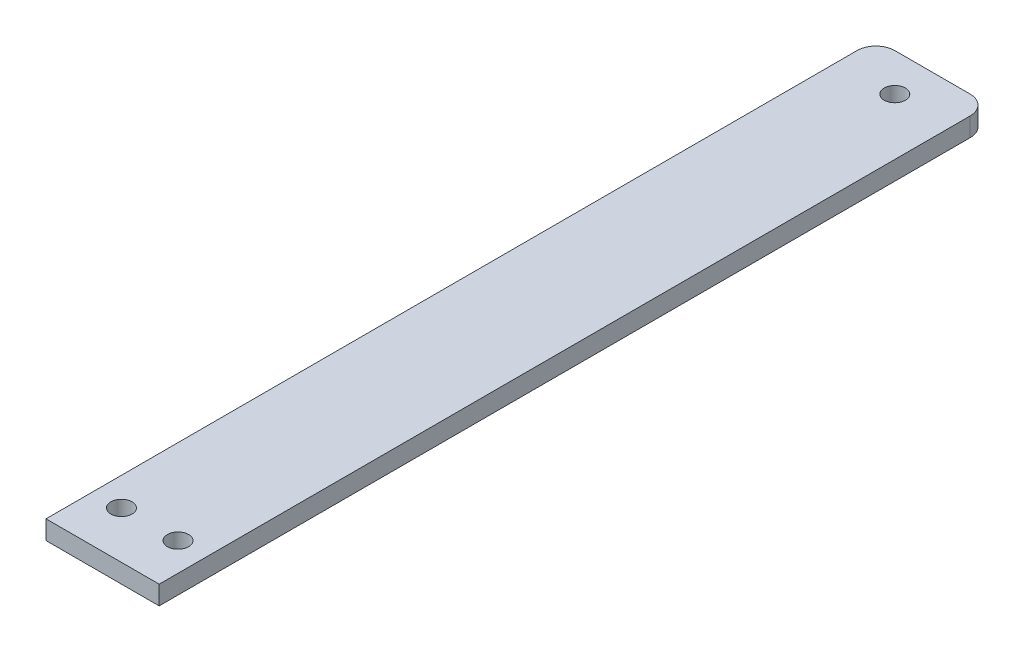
ISO-10303-21;
HEADER;
FILE_DESCRIPTION(('STEP AP214'),'2;1');
FILE_NAME('part.step','',(''),(''),'','','');
FILE_SCHEMA(('AUTOMOTIVE_DESIGN { 1 0 10303 214 1 1 1 1 }'));
ENDSEC;
DATA;
#1=APPLICATION_CONTEXT('core data for automotive mechanical design processes');
#2=APPLICATION_PROTOCOL_DEFINITION('international standard','automotive_design',2000,#1);
#3=PRODUCT_CONTEXT('',#1,'mechanical');
#4=PRODUCT('Part','Part','',(#3));
#5=PRODUCT_RELATED_PRODUCT_CATEGORY('part','',(#4));
#6=PRODUCT_DEFINITION_FORMATION('','',#4);
#7=PRODUCT_DEFINITION_CONTEXT('part definition',#1,'design');
#8=PRODUCT_DEFINITION('design','',#6,#7);
#9=PRODUCT_DEFINITION_SHAPE('','',#8);
#10=(LENGTH_UNIT() NAMED_UNIT(*) SI_UNIT(.MILLI.,.METRE.));
#11=(NAMED_UNIT(*) PLANE_ANGLE_UNIT() SI_UNIT($,.RADIAN.));
#12=(NAMED_UNIT(*) SI_UNIT($,.STERADIAN.) SOLID_ANGLE_UNIT());
#13=UNCERTAINTY_MEASURE_WITH_UNIT(LENGTH_MEASURE(1.E-05),#10,'distance_accuracy_value','');
#14=(GEOMETRIC_REPRESENTATION_CONTEXT(3) GLOBAL_UNCERTAINTY_ASSIGNED_CONTEXT((#13)) GLOBAL_UNIT_ASSIGNED_CONTEXT((#10,
#11,#12)) REPRESENTATION_CONTEXT('',''));
#15=CARTESIAN_POINT('',(0.,0.,0.));
#16=DIRECTION('',(0.,0.,1.));
#17=DIRECTION('',(1.,0.,0.));
#18=AXIS2_PLACEMENT_3D('',#15,#16,#17);
#19=CARTESIAN_POINT('',(0.,6.35,0.));
#20=DIRECTION('',(0.,-1.,0.));
#21=DIRECTION('',(0.,0.,-1.));
#22=AXIS2_PLACEMENT_3D('',#19,#20,#21);
#23=PLANE('',#22);
#24=DIRECTION('',(-1.,0.,0.));
#25=VECTOR('',#24,1.);
#26=CARTESIAN_POINT('',(-19.05,6.35,-139.7));
#27=LINE('',#26,#25);
#28=CARTESIAN_POINT('',(12.7,6.35,-139.7));
#29=VERTEX_POINT('',#28);
#30=CARTESIAN_POINT('',(-12.7,6.35,-139.7));
#31=VERTEX_POINT('',#30);
#32=EDGE_CURVE('E105',#29,#31,#27,.T.);
#33=ORIENTED_EDGE('',*,*,#32,.T.);
#34=CARTESIAN_POINT('',(-12.7,6.35,-133.35));
#35=DIRECTION('',(0.,-1.,0.));
#36=DIRECTION('',(0.,0.,-1.));
#37=AXIS2_PLACEMENT_3D('',#34,#35,#36);
#38=CIRCLE('',#37,6.35);
#39=CARTESIAN_POINT('',(-19.05,6.35,-133.35));
#40=VERTEX_POINT('',#39);
#41=EDGE_CURVE('E48',#31,#40,#38,.F.);
#42=ORIENTED_EDGE('',*,*,#41,.T.);
#43=DIRECTION('',(0.,0.,1.));
#44=VECTOR('',#43,1.);
#45=CARTESIAN_POINT('',(-19.05,6.35,139.7));
#46=LINE('',#45,#44);
#47=CARTESIAN_POINT('',(-19.05,6.35,139.7));
#48=VERTEX_POINT('',#47);
#49=EDGE_CURVE('E94',#40,#48,#46,.T.);
#50=ORIENTED_EDGE('',*,*,#49,.T.);
#51=DIRECTION('',(1.,0.,0.));
#52=VECTOR('',#51,1.);
#53=CARTESIAN_POINT('',(-19.05,6.35,139.7));
#54=LINE('',#53,#52);
#55=CARTESIAN_POINT('',(19.05,6.35,139.7));
#56=VERTEX_POINT('',#55);
#57=EDGE_CURVE('E98',#48,#56,#54,.T.);
#58=ORIENTED_EDGE('',*,*,#57,.T.);
#59=DIRECTION('',(0.,0.,-1.));
#60=VECTOR('',#59,1.);
#61=CARTESIAN_POINT('',(19.05,6.35,139.7));
#62=LINE('',#61,#60);
#63=CARTESIAN_POINT('',(19.05,6.35,-133.35));
#64=VERTEX_POINT('',#63);
#65=EDGE_CURVE('E137',#56,#64,#62,.T.);
#66=ORIENTED_EDGE('',*,*,#65,.T.);
#67=CARTESIAN_POINT('',(12.7,6.35,-133.35));
#68=DIRECTION('',(0.,-1.,0.));
#69=DIRECTION('',(0.,0.,-1.));
#70=AXIS2_PLACEMENT_3D('',#67,#68,#69);
#71=CIRCLE('',#70,6.35);
#72=EDGE_CURVE('E153',#64,#29,#71,.F.);
#73=ORIENTED_EDGE('',*,*,#72,.T.);
#74=EDGE_LOOP('',(#33,#42,#50,#58,#66,#73));
#75=FACE_BOUND('',#74,.T.);
#76=CARTESIAN_POINT('',(0.,6.35,-127.));
#77=DIRECTION('',(0.,1.,0.));
#78=DIRECTION('',(0.,0.,1.));
#79=AXIS2_PLACEMENT_3D('',#76,#77,#78);
#80=CIRCLE('',#79,3.571875);
#81=CARTESIAN_POINT('',(0.,6.35,-123.428125));
#82=VERTEX_POINT('',#81);
#83=EDGE_CURVE('E130',#82,#82,#80,.T.);
#84=ORIENTED_EDGE('',*,*,#83,.F.);
#85=EDGE_LOOP('',(#84));
#86=FACE_BOUND('',#85,.T.);
#87=CARTESIAN_POINT('',(-9.52499999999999,6.35,123.825));
#88=DIRECTION('',(0.,1.,0.));
#89=DIRECTION('',(0.,0.,1.));
#90=AXIS2_PLACEMENT_3D('',#87,#88,#89);
#91=CIRCLE('',#90,3.571875);
#92=CARTESIAN_POINT('',(-9.52499999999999,6.35,127.396875));
#93=VERTEX_POINT('',#92);
#94=EDGE_CURVE('E174',#93,#93,#91,.T.);
#95=ORIENTED_EDGE('',*,*,#94,.F.);
#96=EDGE_LOOP('',(#95));
#97=FACE_BOUND('',#96,.T.);
#98=CARTESIAN_POINT('',(9.52500000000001,6.35,123.825));
#99=DIRECTION('',(0.,1.,0.));
#100=DIRECTION('',(0.,0.,1.));
#101=AXIS2_PLACEMENT_3D('',#98,#99,#100);
#102=CIRCLE('',#101,3.571875);
#103=CARTESIAN_POINT('',(9.52500000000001,6.35,127.396875));
#104=VERTEX_POINT('',#103);
#105=EDGE_CURVE('E182',#104,#104,#102,.T.);
#106=ORIENTED_EDGE('',*,*,#105,.F.);
#107=EDGE_LOOP('',(#106));
#108=FACE_BOUND('',#107,.T.);
#109=ADVANCED_FACE('F39',(#75,#86,#97,#108),#23,.F.);
#110=CARTESIAN_POINT('',(0.,0.,0.));
#111=DIRECTION('',(0.,-1.,0.));
#112=DIRECTION('',(0.,0.,-1.));
#113=AXIS2_PLACEMENT_3D('',#110,#111,#112);
#114=PLANE('',#113);
#115=CARTESIAN_POINT('',(-9.52499999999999,0.,123.825));
#116=DIRECTION('',(0.,1.,0.));
#117=DIRECTION('',(0.,0.,1.));
#118=AXIS2_PLACEMENT_3D('',#115,#116,#117);
#119=CIRCLE('',#118,3.571875);
#120=CARTESIAN_POINT('',(-9.52499999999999,0.,127.396875));
#121=VERTEX_POINT('',#120);
#122=EDGE_CURVE('E178',#121,#121,#119,.T.);
#123=ORIENTED_EDGE('',*,*,#122,.T.);
#124=EDGE_LOOP('',(#123));
#125=FACE_BOUND('',#124,.T.);
#126=DIRECTION('',(0.,0.,1.));
#127=VECTOR('',#126,1.);
#128=CARTESIAN_POINT('',(-19.05,0.,139.7));
#129=LINE('',#128,#127);
#130=CARTESIAN_POINT('',(-19.05,0.,-133.35));
#131=VERTEX_POINT('',#130);
#132=CARTESIAN_POINT('',(-19.05,0.,139.7));
#133=VERTEX_POINT('',#132);
#134=EDGE_CURVE('E111',#131,#133,#129,.T.);
#135=ORIENTED_EDGE('',*,*,#134,.F.);
#136=CARTESIAN_POINT('',(-12.7,0.,-133.35));
#137=DIRECTION('',(0.,-1.,0.));
#138=DIRECTION('',(0.,0.,-1.));
#139=AXIS2_PLACEMENT_3D('',#136,#137,#138);
#140=CIRCLE('',#139,6.35);
#141=CARTESIAN_POINT('',(-12.7,0.,-139.7));
#142=VERTEX_POINT('',#141);
#143=EDGE_CURVE('E144',#131,#142,#140,.T.);
#144=ORIENTED_EDGE('',*,*,#143,.T.);
#145=DIRECTION('',(-1.,0.,0.));
#146=VECTOR('',#145,1.);
#147=CARTESIAN_POINT('',(-19.05,0.,-139.7));
#148=LINE('',#147,#146);
#149=CARTESIAN_POINT('',(12.7,0.,-139.7));
#150=VERTEX_POINT('',#149);
#151=EDGE_CURVE('E129',#150,#142,#148,.T.);
#152=ORIENTED_EDGE('',*,*,#151,.F.);
#153=CARTESIAN_POINT('',(12.7,0.,-133.35));
#154=DIRECTION('',(0.,-1.,0.));
#155=DIRECTION('',(0.,0.,-1.));
#156=AXIS2_PLACEMENT_3D('',#153,#154,#155);
#157=CIRCLE('',#156,6.35);
#158=CARTESIAN_POINT('',(19.05,0.,-133.35));
#159=VERTEX_POINT('',#158);
#160=EDGE_CURVE('E141',#150,#159,#157,.T.);
#161=ORIENTED_EDGE('',*,*,#160,.T.);
#162=DIRECTION('',(0.,0.,-1.));
#163=VECTOR('',#162,1.);
#164=CARTESIAN_POINT('',(19.05,0.,139.7));
#165=LINE('',#164,#163);
#166=CARTESIAN_POINT('',(19.05,0.,139.7));
#167=VERTEX_POINT('',#166);
#168=EDGE_CURVE('E126',#167,#159,#165,.T.);
#169=ORIENTED_EDGE('',*,*,#168,.F.);
#170=DIRECTION('',(1.,0.,0.));
#171=VECTOR('',#170,1.);
#172=CARTESIAN_POINT('',(-19.05,0.,139.7));
#173=LINE('',#172,#171);
#174=EDGE_CURVE('E135',#133,#167,#173,.T.);
#175=ORIENTED_EDGE('',*,*,#174,.F.);
#176=EDGE_LOOP('',(#135,#144,#152,#161,#169,#175));
#177=FACE_BOUND('',#176,.T.);
#178=CARTESIAN_POINT('',(0.,0.,-127.));
#179=DIRECTION('',(0.,1.,0.));
#180=DIRECTION('',(0.,0.,1.));
#181=AXIS2_PLACEMENT_3D('',#178,#179,#180);
#182=CIRCLE('',#181,3.571875);
#183=CARTESIAN_POINT('',(0.,0.,-123.428125));
#184=VERTEX_POINT('',#183);
#185=EDGE_CURVE('E170',#184,#184,#182,.T.);
#186=ORIENTED_EDGE('',*,*,#185,.T.);
#187=EDGE_LOOP('',(#186));
#188=FACE_BOUND('',#187,.T.);
#189=CARTESIAN_POINT('',(9.52500000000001,0.,123.825));
#190=DIRECTION('',(0.,1.,0.));
#191=DIRECTION('',(0.,0.,1.));
#192=AXIS2_PLACEMENT_3D('',#189,#190,#191);
#193=CIRCLE('',#192,3.571875);
#194=CARTESIAN_POINT('',(9.52500000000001,0.,127.396875));
#195=VERTEX_POINT('',#194);
#196=EDGE_CURVE('E186',#195,#195,#193,.T.);
#197=ORIENTED_EDGE('',*,*,#196,.T.);
#198=EDGE_LOOP('',(#197));
#199=FACE_BOUND('',#198,.T.);
#200=ADVANCED_FACE('F164',(#125,#177,#188,#199),#114,.T.);
#201=CARTESIAN_POINT('',(19.05,6.35,139.7));
#202=DIRECTION('',(-1.,0.,0.));
#203=DIRECTION('',(0.,0.,1.));
#204=AXIS2_PLACEMENT_3D('',#201,#202,#203);
#205=PLANE('',#204);
#206=ORIENTED_EDGE('',*,*,#168,.T.);
#207=DIRECTION('',(0.,-1.,0.));
#208=VECTOR('',#207,1.);
#209=CARTESIAN_POINT('',(19.05,6.35,-133.35));
#210=LINE('',#209,#208);
#211=EDGE_CURVE('E11',#159,#64,#210,.F.);
#212=ORIENTED_EDGE('',*,*,#211,.T.);
#213=ORIENTED_EDGE('',*,*,#65,.F.);
#214=DIRECTION('',(0.,-1.,0.));
#215=VECTOR('',#214,1.);
#216=CARTESIAN_POINT('',(19.05,6.35,139.7));
#217=LINE('',#216,#215);
#218=EDGE_CURVE('E116',#56,#167,#217,.T.);
#219=ORIENTED_EDGE('',*,*,#218,.T.);
#220=EDGE_LOOP('',(#206,#212,#213,#219));
#221=FACE_BOUND('',#220,.T.);
#222=ADVANCED_FACE('F166',(#221),#205,.F.);
#223=CARTESIAN_POINT('',(-19.05,6.35,-139.7));
#224=DIRECTION('',(0.,0.,1.));
#225=DIRECTION('',(1.,0.,0.));
#226=AXIS2_PLACEMENT_3D('',#223,#224,#225);
#227=PLANE('',#226);
#228=ORIENTED_EDGE('',*,*,#151,.T.);
#229=DIRECTION('',(0.,-1.,0.));
#230=VECTOR('',#229,1.);
#231=CARTESIAN_POINT('',(-12.7,6.35,-139.7));
#232=LINE('',#231,#230);
#233=EDGE_CURVE('E61',#142,#31,#232,.F.);
#234=ORIENTED_EDGE('',*,*,#233,.T.);
#235=ORIENTED_EDGE('',*,*,#32,.F.);
#236=DIRECTION('',(0.,-1.,0.));
#237=VECTOR('',#236,1.);
#238=CARTESIAN_POINT('',(12.7,6.35,-139.7));
#239=LINE('',#238,#237);
#240=EDGE_CURVE('E147',#29,#150,#239,.T.);
#241=ORIENTED_EDGE('',*,*,#240,.T.);
#242=EDGE_LOOP('',(#228,#234,#235,#241));
#243=FACE_BOUND('',#242,.T.);
#244=ADVANCED_FACE('F159',(#243),#227,.F.);
#245=CARTESIAN_POINT('',(-19.05,6.35,139.7));
#246=DIRECTION('',(1.,0.,0.));
#247=DIRECTION('',(0.,0.,-1.));
#248=AXIS2_PLACEMENT_3D('',#245,#246,#247);
#249=PLANE('',#248);
#250=ORIENTED_EDGE('',*,*,#49,.F.);
#251=DIRECTION('',(0.,-1.,0.));
#252=VECTOR('',#251,1.);
#253=CARTESIAN_POINT('',(-19.05,6.35,-133.35));
#254=LINE('',#253,#252);
#255=EDGE_CURVE('E115',#40,#131,#254,.T.);
#256=ORIENTED_EDGE('',*,*,#255,.T.);
#257=ORIENTED_EDGE('',*,*,#134,.T.);
#258=DIRECTION('',(0.,-1.,0.));
#259=VECTOR('',#258,1.);
#260=CARTESIAN_POINT('',(-19.05,6.35,139.7));
#261=LINE('',#260,#259);
#262=EDGE_CURVE('E108',#48,#133,#261,.T.);
#263=ORIENTED_EDGE('',*,*,#262,.F.);
#264=EDGE_LOOP('',(#250,#256,#257,#263));
#265=FACE_BOUND('',#264,.T.);
#266=ADVANCED_FACE('F109',(#265),#249,.F.);
#267=CARTESIAN_POINT('',(-19.05,6.35,139.7));
#268=DIRECTION('',(0.,0.,-1.));
#269=DIRECTION('',(-1.,0.,0.));
#270=AXIS2_PLACEMENT_3D('',#267,#268,#269);
#271=PLANE('',#270);
#272=ORIENTED_EDGE('',*,*,#174,.T.);
#273=ORIENTED_EDGE('',*,*,#218,.F.);
#274=ORIENTED_EDGE('',*,*,#57,.F.);
#275=ORIENTED_EDGE('',*,*,#262,.T.);
#276=EDGE_LOOP('',(#272,#273,#274,#275));
#277=FACE_BOUND('',#276,.T.);
#278=ADVANCED_FACE('F118',(#277),#271,.F.);
#279=CARTESIAN_POINT('',(0.,6.35,-127.));
#280=DIRECTION('',(0.,-1.,0.));
#281=DIRECTION('',(0.,0.,-1.));
#282=AXIS2_PLACEMENT_3D('',#279,#280,#281);
#283=CYLINDRICAL_SURFACE('',#282,3.571875);
#284=ORIENTED_EDGE('',*,*,#83,.T.);
#285=EDGE_LOOP('',(#284));
#286=FACE_BOUND('',#285,.T.);
#287=ORIENTED_EDGE('',*,*,#185,.F.);
#288=EDGE_LOOP('',(#287));
#289=FACE_BOUND('',#288,.T.);
#290=ADVANCED_FACE('F205',(#286,#289),#283,.F.);
#291=CARTESIAN_POINT('',(-9.52499999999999,6.35,123.825));
#292=DIRECTION('',(0.,-1.,0.));
#293=DIRECTION('',(0.,0.,-1.));
#294=AXIS2_PLACEMENT_3D('',#291,#292,#293);
#295=CYLINDRICAL_SURFACE('',#294,3.571875);
#296=ORIENTED_EDGE('',*,*,#94,.T.);
#297=EDGE_LOOP('',(#296));
#298=FACE_BOUND('',#297,.T.);
#299=ORIENTED_EDGE('',*,*,#122,.F.);
#300=EDGE_LOOP('',(#299));
#301=FACE_BOUND('',#300,.T.);
#302=ADVANCED_FACE('F222',(#298,#301),#295,.F.);
#303=CARTESIAN_POINT('',(9.52500000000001,6.35,123.825));
#304=DIRECTION('',(0.,-1.,0.));
#305=DIRECTION('',(0.,0.,-1.));
#306=AXIS2_PLACEMENT_3D('',#303,#304,#305);
#307=CYLINDRICAL_SURFACE('',#306,3.571875);
#308=ORIENTED_EDGE('',*,*,#105,.T.);
#309=EDGE_LOOP('',(#308));
#310=FACE_BOUND('',#309,.T.);
#311=ORIENTED_EDGE('',*,*,#196,.F.);
#312=EDGE_LOOP('',(#311));
#313=FACE_BOUND('',#312,.T.);
#314=ADVANCED_FACE('F194',(#310,#313),#307,.F.);
#315=CARTESIAN_POINT('',(-12.7,6.35,-133.35));
#316=DIRECTION('',(0.,-1.,0.));
#317=DIRECTION('',(0.,0.,-1.));
#318=AXIS2_PLACEMENT_3D('',#315,#316,#317);
#319=CYLINDRICAL_SURFACE('',#318,6.35);
#320=ORIENTED_EDGE('',*,*,#41,.F.);
#321=ORIENTED_EDGE('',*,*,#233,.F.);
#322=ORIENTED_EDGE('',*,*,#143,.F.);
#323=ORIENTED_EDGE('',*,*,#255,.F.);
#324=EDGE_LOOP('',(#320,#321,#322,#323));
#325=FACE_BOUND('',#324,.T.);
#326=ADVANCED_FACE('F215',(#325),#319,.T.);
#327=CARTESIAN_POINT('',(12.7,6.35,-133.35));
#328=DIRECTION('',(0.,-1.,0.));
#329=DIRECTION('',(0.,0.,-1.));
#330=AXIS2_PLACEMENT_3D('',#327,#328,#329);
#331=CYLINDRICAL_SURFACE('',#330,6.35);
#332=ORIENTED_EDGE('',*,*,#72,.F.);
#333=ORIENTED_EDGE('',*,*,#211,.F.);
#334=ORIENTED_EDGE('',*,*,#160,.F.);
#335=ORIENTED_EDGE('',*,*,#240,.F.);
#336=EDGE_LOOP('',(#332,#333,#334,#335));
#337=FACE_BOUND('',#336,.T.);
#338=ADVANCED_FACE('F41',(#337),#331,.T.);
#339=CLOSED_SHELL('',(#109,#200,#222,#244,#266,#278,#290,#302,#314,#326,#338));
#340=MANIFOLD_SOLID_BREP('B2',#339);
#341=ADVANCED_BREP_SHAPE_REPRESENTATION('',(#18,#340),#14);
#342=SHAPE_DEFINITION_REPRESENTATION(#9,#341);
ENDSEC;
END-ISO-10303-21;
